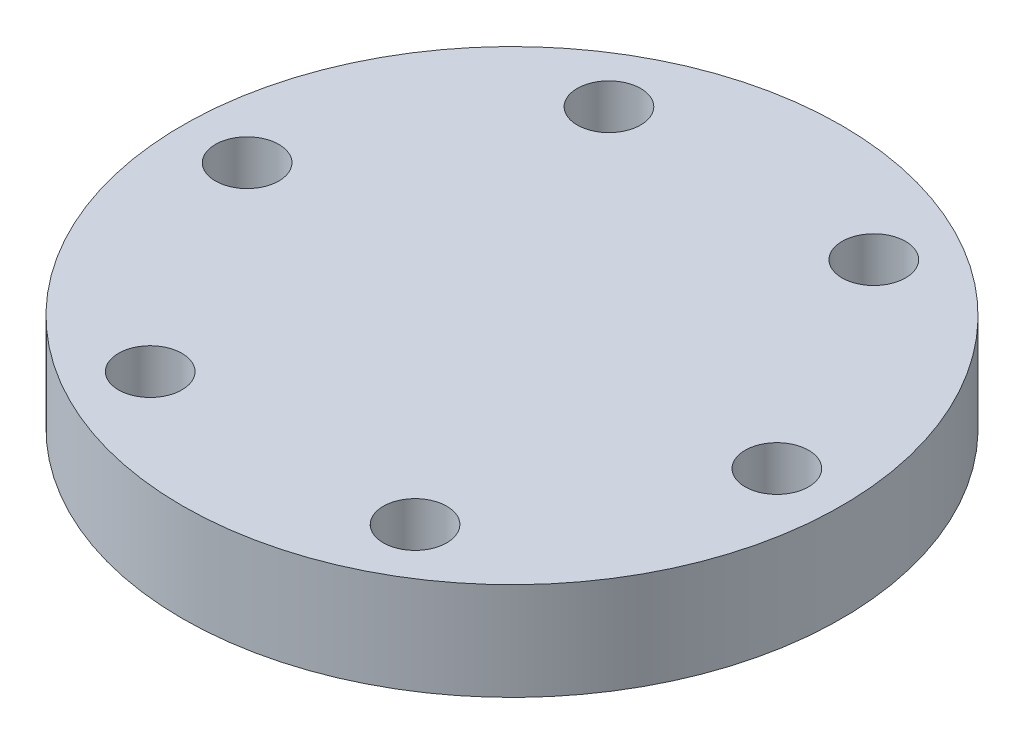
ISO-10303-21;
HEADER;
FILE_DESCRIPTION(('STEP AP214'),'2;1');
FILE_NAME('part.step','',(''),(''),'','','');
FILE_SCHEMA(('AUTOMOTIVE_DESIGN { 1 0 10303 214 1 1 1 1 }'));
ENDSEC;
DATA;
#1=APPLICATION_CONTEXT('core data for automotive mechanical design processes');
#2=APPLICATION_PROTOCOL_DEFINITION('international standard','automotive_design',2000,#1);
#3=PRODUCT_CONTEXT('',#1,'mechanical');
#4=PRODUCT('Part','Part','',(#3));
#5=PRODUCT_RELATED_PRODUCT_CATEGORY('part','',(#4));
#6=PRODUCT_DEFINITION_FORMATION('','',#4);
#7=PRODUCT_DEFINITION_CONTEXT('part definition',#1,'design');
#8=PRODUCT_DEFINITION('design','',#6,#7);
#9=PRODUCT_DEFINITION_SHAPE('','',#8);
#10=(LENGTH_UNIT() NAMED_UNIT(*) SI_UNIT(.MILLI.,.METRE.));
#11=(NAMED_UNIT(*) PLANE_ANGLE_UNIT() SI_UNIT($,.RADIAN.));
#12=(NAMED_UNIT(*) SI_UNIT($,.STERADIAN.) SOLID_ANGLE_UNIT());
#13=UNCERTAINTY_MEASURE_WITH_UNIT(LENGTH_MEASURE(1.E-05),#10,'distance_accuracy_value','');
#14=(GEOMETRIC_REPRESENTATION_CONTEXT(3) GLOBAL_UNCERTAINTY_ASSIGNED_CONTEXT((#13)) GLOBAL_UNIT_ASSIGNED_CONTEXT((#10,
#11,#12)) REPRESENTATION_CONTEXT('',''));
#15=CARTESIAN_POINT('',(0.,0.,0.));
#16=DIRECTION('',(0.,0.,1.));
#17=DIRECTION('',(1.,0.,0.));
#18=AXIS2_PLACEMENT_3D('',#15,#16,#17);
#19=CARTESIAN_POINT('',(0.,8.,0.));
#20=DIRECTION('',(0.,-1.,0.));
#21=DIRECTION('',(0.,0.,-1.));
#22=AXIS2_PLACEMENT_3D('',#19,#20,#21);
#23=CYLINDRICAL_SURFACE('',#22,27.);
#24=CARTESIAN_POINT('',(0.,8.,0.));
#25=DIRECTION('',(0.,1.,0.));
#26=DIRECTION('',(0.,0.,1.));
#27=AXIS2_PLACEMENT_3D('',#24,#25,#26);
#28=CIRCLE('',#27,27.);
#29=CARTESIAN_POINT('',(0.,8.,27.));
#30=VERTEX_POINT('',#29);
#31=EDGE_CURVE('E10',#30,#30,#28,.T.);
#32=ORIENTED_EDGE('',*,*,#31,.F.);
#33=EDGE_LOOP('',(#32));
#34=FACE_BOUND('',#33,.T.);
#35=CARTESIAN_POINT('',(0.,0.,0.));
#36=DIRECTION('',(0.,1.,0.));
#37=DIRECTION('',(0.,0.,1.));
#38=AXIS2_PLACEMENT_3D('',#35,#36,#37);
#39=CIRCLE('',#38,27.);
#40=CARTESIAN_POINT('',(0.,0.,27.));
#41=VERTEX_POINT('',#40);
#42=EDGE_CURVE('E45',#41,#41,#39,.T.);
#43=ORIENTED_EDGE('',*,*,#42,.T.);
#44=EDGE_LOOP('',(#43));
#45=FACE_BOUND('',#44,.T.);
#46=ADVANCED_FACE('F42',(#34,#45),#23,.T.);
#47=CARTESIAN_POINT('',(0.,8.,0.));
#48=DIRECTION('',(0.,1.,0.));
#49=DIRECTION('',(0.,0.,1.));
#50=AXIS2_PLACEMENT_3D('',#47,#48,#49);
#51=PLANE('',#50);
#52=CARTESIAN_POINT('',(-21.7,8.,0.));
#53=DIRECTION('',(0.,1.,0.));
#54=DIRECTION('',(0.,0.,1.));
#55=AXIS2_PLACEMENT_3D('',#52,#53,#54);
#56=CIRCLE('',#55,2.6);
#57=CARTESIAN_POINT('',(-21.7,8.,2.6));
#58=VERTEX_POINT('',#57);
#59=EDGE_CURVE('E89',#58,#58,#56,.T.);
#60=ORIENTED_EDGE('',*,*,#59,.F.);
#61=EDGE_LOOP('',(#60));
#62=FACE_BOUND('',#61,.T.);
#63=CARTESIAN_POINT('',(-10.8500000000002,8.,18.7927512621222));
#64=DIRECTION('',(0.,1.,0.));
#65=DIRECTION('',(0.,0.,1.));
#66=AXIS2_PLACEMENT_3D('',#63,#64,#65);
#67=CIRCLE('',#66,2.6);
#68=CARTESIAN_POINT('',(-10.8500000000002,8.,21.3927512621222));
#69=VERTEX_POINT('',#68);
#70=EDGE_CURVE('E61',#69,#69,#67,.T.);
#71=ORIENTED_EDGE('',*,*,#70,.F.);
#72=EDGE_LOOP('',(#71));
#73=FACE_BOUND('',#72,.T.);
#74=CARTESIAN_POINT('',(10.8499999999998,8.,18.7927512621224));
#75=DIRECTION('',(0.,1.,0.));
#76=DIRECTION('',(0.,0.,1.));
#77=AXIS2_PLACEMENT_3D('',#74,#75,#76);
#78=CIRCLE('',#77,2.6);
#79=CARTESIAN_POINT('',(10.8499999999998,8.,21.3927512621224));
#80=VERTEX_POINT('',#79);
#81=EDGE_CURVE('E60',#80,#80,#78,.T.);
#82=ORIENTED_EDGE('',*,*,#81,.F.);
#83=EDGE_LOOP('',(#82));
#84=FACE_BOUND('',#83,.T.);
#85=CARTESIAN_POINT('',(21.7,8.,1.51530290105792E-13));
#86=DIRECTION('',(0.,1.,0.));
#87=DIRECTION('',(0.,0.,1.));
#88=AXIS2_PLACEMENT_3D('',#85,#86,#87);
#89=CIRCLE('',#88,2.6);
#90=CARTESIAN_POINT('',(21.7,8.,2.60000000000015));
#91=VERTEX_POINT('',#90);
#92=EDGE_CURVE('E69',#91,#91,#89,.T.);
#93=ORIENTED_EDGE('',*,*,#92,.F.);
#94=EDGE_LOOP('',(#93));
#95=FACE_BOUND('',#94,.T.);
#96=CARTESIAN_POINT('',(10.8500000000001,8.,-18.7927512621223));
#97=DIRECTION('',(0.,1.,0.));
#98=DIRECTION('',(0.,0.,1.));
#99=AXIS2_PLACEMENT_3D('',#96,#97,#98);
#100=CIRCLE('',#99,2.6);
#101=CARTESIAN_POINT('',(10.8500000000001,8.,-16.1927512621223));
#102=VERTEX_POINT('',#101);
#103=EDGE_CURVE('E77',#102,#102,#100,.T.);
#104=ORIENTED_EDGE('',*,*,#103,.F.);
#105=EDGE_LOOP('',(#104));
#106=FACE_BOUND('',#105,.T.);
#107=CARTESIAN_POINT('',(-10.85,8.,-18.7927512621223));
#108=DIRECTION('',(0.,1.,0.));
#109=DIRECTION('',(0.,0.,1.));
#110=AXIS2_PLACEMENT_3D('',#107,#108,#109);
#111=CIRCLE('',#110,2.6);
#112=CARTESIAN_POINT('',(-10.85,8.,-16.1927512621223));
#113=VERTEX_POINT('',#112);
#114=EDGE_CURVE('E85',#113,#113,#111,.T.);
#115=ORIENTED_EDGE('',*,*,#114,.F.);
#116=EDGE_LOOP('',(#115));
#117=FACE_BOUND('',#116,.T.);
#118=ORIENTED_EDGE('',*,*,#31,.T.);
#119=EDGE_LOOP('',(#118));
#120=FACE_BOUND('',#119,.T.);
#121=ADVANCED_FACE('F114',(#62,#73,#84,#95,#106,#117,#120),#51,.T.);
#122=CARTESIAN_POINT('',(0.,0.,0.));
#123=DIRECTION('',(0.,1.,0.));
#124=DIRECTION('',(0.,0.,1.));
#125=AXIS2_PLACEMENT_3D('',#122,#123,#124);
#126=PLANE('',#125);
#127=CARTESIAN_POINT('',(-21.7,0.,0.));
#128=DIRECTION('',(0.,1.,0.));
#129=DIRECTION('',(0.,0.,1.));
#130=AXIS2_PLACEMENT_3D('',#127,#128,#129);
#131=CIRCLE('',#130,2.6);
#132=CARTESIAN_POINT('',(-21.7,0.,2.6));
#133=VERTEX_POINT('',#132);
#134=EDGE_CURVE('E54',#133,#133,#131,.T.);
#135=ORIENTED_EDGE('',*,*,#134,.T.);
#136=EDGE_LOOP('',(#135));
#137=FACE_BOUND('',#136,.T.);
#138=CARTESIAN_POINT('',(-10.8500000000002,0.,18.7927512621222));
#139=DIRECTION('',(0.,1.,0.));
#140=DIRECTION('',(0.,0.,1.));
#141=AXIS2_PLACEMENT_3D('',#138,#139,#140);
#142=CIRCLE('',#141,2.6);
#143=CARTESIAN_POINT('',(-10.8500000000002,0.,21.3927512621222));
#144=VERTEX_POINT('',#143);
#145=EDGE_CURVE('E90',#144,#144,#142,.T.);
#146=ORIENTED_EDGE('',*,*,#145,.T.);
#147=EDGE_LOOP('',(#146));
#148=FACE_BOUND('',#147,.T.);
#149=CARTESIAN_POINT('',(10.8499999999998,0.,18.7927512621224));
#150=DIRECTION('',(0.,1.,0.));
#151=DIRECTION('',(0.,0.,1.));
#152=AXIS2_PLACEMENT_3D('',#149,#150,#151);
#153=CIRCLE('',#152,2.6);
#154=CARTESIAN_POINT('',(10.8499999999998,0.,21.3927512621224));
#155=VERTEX_POINT('',#154);
#156=EDGE_CURVE('E56',#155,#155,#153,.T.);
#157=ORIENTED_EDGE('',*,*,#156,.T.);
#158=EDGE_LOOP('',(#157));
#159=FACE_BOUND('',#158,.T.);
#160=CARTESIAN_POINT('',(21.7,0.,1.51530290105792E-13));
#161=DIRECTION('',(0.,1.,0.));
#162=DIRECTION('',(0.,0.,1.));
#163=AXIS2_PLACEMENT_3D('',#160,#161,#162);
#164=CIRCLE('',#163,2.6);
#165=CARTESIAN_POINT('',(21.7,0.,2.60000000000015));
#166=VERTEX_POINT('',#165);
#167=EDGE_CURVE('E65',#166,#166,#164,.T.);
#168=ORIENTED_EDGE('',*,*,#167,.T.);
#169=EDGE_LOOP('',(#168));
#170=FACE_BOUND('',#169,.T.);
#171=CARTESIAN_POINT('',(10.8500000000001,0.,-18.7927512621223));
#172=DIRECTION('',(0.,1.,0.));
#173=DIRECTION('',(0.,0.,1.));
#174=AXIS2_PLACEMENT_3D('',#171,#172,#173);
#175=CIRCLE('',#174,2.6);
#176=CARTESIAN_POINT('',(10.8500000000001,0.,-16.1927512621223));
#177=VERTEX_POINT('',#176);
#178=EDGE_CURVE('E73',#177,#177,#175,.T.);
#179=ORIENTED_EDGE('',*,*,#178,.T.);
#180=EDGE_LOOP('',(#179));
#181=FACE_BOUND('',#180,.T.);
#182=CARTESIAN_POINT('',(-10.85,0.,-18.7927512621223));
#183=DIRECTION('',(0.,1.,0.));
#184=DIRECTION('',(0.,0.,1.));
#185=AXIS2_PLACEMENT_3D('',#182,#183,#184);
#186=CIRCLE('',#185,2.6);
#187=CARTESIAN_POINT('',(-10.85,0.,-16.1927512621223));
#188=VERTEX_POINT('',#187);
#189=EDGE_CURVE('E81',#188,#188,#186,.T.);
#190=ORIENTED_EDGE('',*,*,#189,.T.);
#191=EDGE_LOOP('',(#190));
#192=FACE_BOUND('',#191,.T.);
#193=ORIENTED_EDGE('',*,*,#42,.F.);
#194=EDGE_LOOP('',(#193));
#195=FACE_BOUND('',#194,.T.);
#196=ADVANCED_FACE('F104',(#137,#148,#159,#170,#181,#192,#195),#126,.F.);
#197=CARTESIAN_POINT('',(-10.85,0.,-18.7927512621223));
#198=DIRECTION('',(0.,1.,0.));
#199=DIRECTION('',(0.,0.,1.));
#200=AXIS2_PLACEMENT_3D('',#197,#198,#199);
#201=CYLINDRICAL_SURFACE('',#200,2.6);
#202=ORIENTED_EDGE('',*,*,#189,.F.);
#203=EDGE_LOOP('',(#202));
#204=FACE_BOUND('',#203,.T.);
#205=ORIENTED_EDGE('',*,*,#114,.T.);
#206=EDGE_LOOP('',(#205));
#207=FACE_BOUND('',#206,.T.);
#208=ADVANCED_FACE('F128',(#204,#207),#201,.F.);
#209=CARTESIAN_POINT('',(10.8500000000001,0.,-18.7927512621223));
#210=DIRECTION('',(0.,1.,0.));
#211=DIRECTION('',(0.,0.,1.));
#212=AXIS2_PLACEMENT_3D('',#209,#210,#211);
#213=CYLINDRICAL_SURFACE('',#212,2.6);
#214=ORIENTED_EDGE('',*,*,#178,.F.);
#215=EDGE_LOOP('',(#214));
#216=FACE_BOUND('',#215,.T.);
#217=ORIENTED_EDGE('',*,*,#103,.T.);
#218=EDGE_LOOP('',(#217));
#219=FACE_BOUND('',#218,.T.);
#220=ADVANCED_FACE('F130',(#216,#219),#213,.F.);
#221=CARTESIAN_POINT('',(21.7,0.,1.51530290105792E-13));
#222=DIRECTION('',(0.,1.,0.));
#223=DIRECTION('',(0.,0.,1.));
#224=AXIS2_PLACEMENT_3D('',#221,#222,#223);
#225=CYLINDRICAL_SURFACE('',#224,2.6);
#226=ORIENTED_EDGE('',*,*,#167,.F.);
#227=EDGE_LOOP('',(#226));
#228=FACE_BOUND('',#227,.T.);
#229=ORIENTED_EDGE('',*,*,#92,.T.);
#230=EDGE_LOOP('',(#229));
#231=FACE_BOUND('',#230,.T.);
#232=ADVANCED_FACE('F137',(#228,#231),#225,.F.);
#233=CARTESIAN_POINT('',(10.8499999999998,0.,18.7927512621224));
#234=DIRECTION('',(0.,1.,0.));
#235=DIRECTION('',(0.,0.,1.));
#236=AXIS2_PLACEMENT_3D('',#233,#234,#235);
#237=CYLINDRICAL_SURFACE('',#236,2.6);
#238=ORIENTED_EDGE('',*,*,#156,.F.);
#239=EDGE_LOOP('',(#238));
#240=FACE_BOUND('',#239,.T.);
#241=ORIENTED_EDGE('',*,*,#81,.T.);
#242=EDGE_LOOP('',(#241));
#243=FACE_BOUND('',#242,.T.);
#244=ADVANCED_FACE('F179',(#240,#243),#237,.F.);
#245=CARTESIAN_POINT('',(-10.8500000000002,0.,18.7927512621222));
#246=DIRECTION('',(0.,1.,0.));
#247=DIRECTION('',(0.,0.,1.));
#248=AXIS2_PLACEMENT_3D('',#245,#246,#247);
#249=CYLINDRICAL_SURFACE('',#248,2.6);
#250=ORIENTED_EDGE('',*,*,#145,.F.);
#251=EDGE_LOOP('',(#250));
#252=FACE_BOUND('',#251,.T.);
#253=ORIENTED_EDGE('',*,*,#70,.T.);
#254=EDGE_LOOP('',(#253));
#255=FACE_BOUND('',#254,.T.);
#256=ADVANCED_FACE('F110',(#252,#255),#249,.F.);
#257=CARTESIAN_POINT('',(-21.7,0.,0.));
#258=DIRECTION('',(0.,1.,0.));
#259=DIRECTION('',(0.,0.,1.));
#260=AXIS2_PLACEMENT_3D('',#257,#258,#259);
#261=CYLINDRICAL_SURFACE('',#260,2.6);
#262=ORIENTED_EDGE('',*,*,#134,.F.);
#263=EDGE_LOOP('',(#262));
#264=FACE_BOUND('',#263,.T.);
#265=ORIENTED_EDGE('',*,*,#59,.T.);
#266=EDGE_LOOP('',(#265));
#267=FACE_BOUND('',#266,.T.);
#268=ADVANCED_FACE('F107',(#264,#267),#261,.F.);
#269=CLOSED_SHELL('',(#46,#121,#196,#208,#220,#232,#244,#256,#268));
#270=MANIFOLD_SOLID_BREP('B2',#269);
#271=ADVANCED_BREP_SHAPE_REPRESENTATION('',(#18,#270),#14);
#272=SHAPE_DEFINITION_REPRESENTATION(#9,#271);
ENDSEC;
END-ISO-10303-21;
